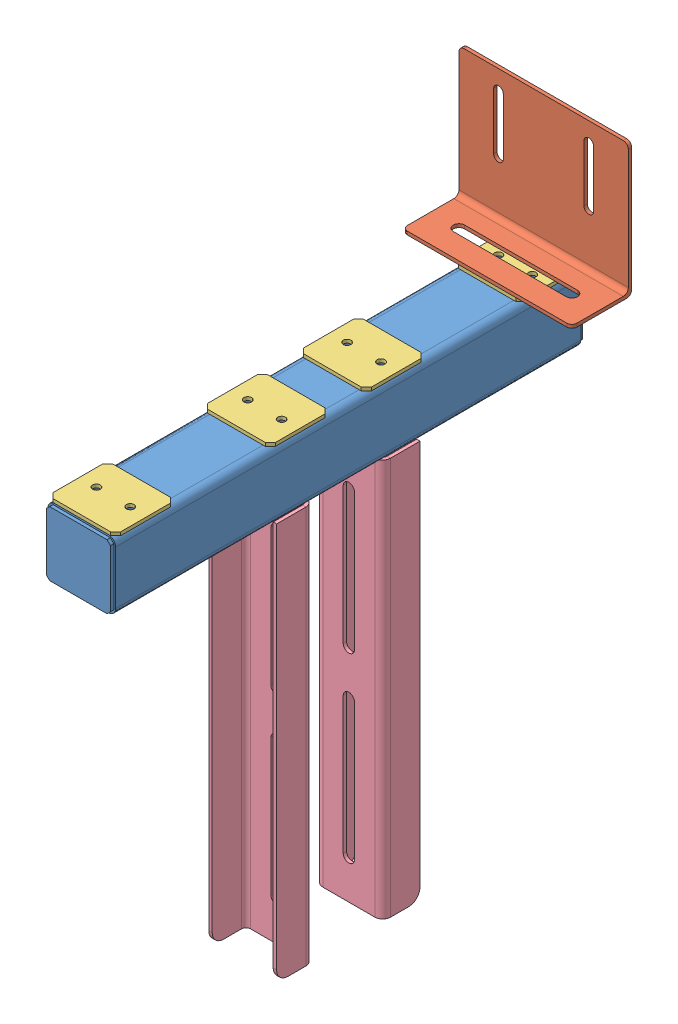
SolidWorks assembly 14L042 Fixation tapis prise sur support.SLDASM, configuration Défaut (file format 10000). Lengths in mm.
Overall size (150 533 418).
11 component instances, 4 part files, 30 mates.
Components (placement in the parent):
- 14L422 Support convoyeur Tapis-1: 14L422 Support convoyeur Tapis.SLDPRT [Défaut<Brut d'usinage>] at (0 0 8) size (60 60 418)
- 14L421 Equerre de fixation convoyeurs-1: 14L421 Equerre de fixation convoyeurs.SLDPRT [Défaut] at (-50 33 -379) x (0 0 1) z (0 1 0) size (53 150 118) (hidden)
- 14L421 Equerre de fixation convoyeurs-2: 14L421 Equerre de fixation convoyeurs.SLDPRT [Défaut] at (50 33 -23) x (0 0 -1) z (0 1 0) size (53 150 118) (hidden)
- 14L421 Equerre de fixation convoyeurs-3: 14L421 Equerre de fixation convoyeurs.SLDPRT [Défaut] at (50 33 -245) x (0 0 -1) z (0 1 0) size (53 150 118) (hidden)
- 14L421 Equerre de fixation convoyeurs-4: 14L421 Equerre de fixation convoyeurs.SLDPRT [Défaut] at (-50 33 -157) x (0 0 1) z (0 1 0) size (53 150 118) (hidden)
- 14L425 Support équerre soudé-1: 14L425 Support équerre soudé.SLDPRT [Défaut] at (-30 30 -407) x (0 0 1) z (0 1 0) size (53 60 3)
- 14L425 Support équerre soudé-2: 14L425 Support équerre soudé.SLDPRT [Défaut] at (30 30 -217) x (0 0 -1) z (0 1 0) size (53 60 3)
- 14L425 Support équerre soudé-3: 14L425 Support équerre soudé.SLDPRT [Défaut] at (-30 30 -185) x (0 0 1) z (0 1 0) size (53 60 3)
- 14L425 Support équerre soudé-4: 14L425 Support équerre soudé.SLDPRT [Défaut] at (30 30 5) x (0 0 -1) z (0 1 0) size (53 60 3)
- 14L425 Equerre Reglage-1: 14L425 Equerre Reglage.SLDPRT [Défaut] at (-30 -382 -170.5) size (60 352 33)
- 14L425 Equerre Reglage-2: 14L425 Equerre Reglage.SLDPRT [Défaut] at (30 -382 -231.5) x (-1 0 0) z (0 0 -1) size (60 352 33)
Mates (geometry in assembly coordinates):
- Coïncidente1: coincident aligned: plane of 14L422 Support convoyeur Tapis-1 through (53.8 0 -407) normal (0 0 -1); plane of 14L421 Equerre de fixation convoyeurs-1 through (-148.5884 92 -407) normal (0 0 -1)
- Coïncidente7: coincident aligned: plane of 14L421 Equerre de fixation convoyeurs-2 through (148.5884 92 5) normal (0 0 1); plane of 14L422 Support convoyeur Tapis-1 through (0 53.8 5) normal (0 0 1)
- Distance1: distance = 3 mm anti-aligned: plane of 14L421 Equerre de fixation convoyeurs-1 through (-75 33 -354) normal (0 -1 0); plane of 14L422 Support convoyeur Tapis-1 through (23.6 30 -410) normal (0 1 0)
- Distance2: distance = 3 mm anti-aligned: plane of 14L422 Support convoyeur Tapis-1 through (23.6 30 -410) normal (0 1 0); plane of 14L421 Equerre de fixation convoyeurs-3 through (75 33 -270) normal (0 -1 0)
- Distance3: distance = 3 mm anti-aligned: plane of 14L422 Support convoyeur Tapis-1 through (23.6 30 -410) normal (0 1 0); plane of 14L421 Equerre de fixation convoyeurs-2 through (75 33 -48) normal (0 -1 0)
- Distance4: distance = 3 mm anti-aligned: plane of 14L421 Equerre de fixation convoyeurs-4 through (-75 33 -132) normal (0 -1 0); plane of 14L422 Support convoyeur Tapis-1 through (23.6 30 -410) normal (0 1 0)
- Distance5: distance = 184 mm anti-aligned: plane of 14L421 Equerre de fixation convoyeurs-4 through (-148.5884 92 -182) normal (0 0 1); plane of 14L421 Equerre de fixation convoyeurs-2 through (148.5884 92 2) normal (0 0 -1)
- Distance6: distance = 184 mm anti-aligned: plane of 14L421 Equerre de fixation convoyeurs-1 through (-148.5884 92 -404) normal (0 0 1); plane of 14L421 Equerre de fixation convoyeurs-3 through (148.5884 92 -220) normal (0 0 -1)
- Coïncidente15: coincident aligned: plane of 14L421 Equerre de fixation convoyeurs-1 through (-75 36 -404) normal (-1 0 0); plane of 14L421 Equerre de fixation convoyeurs-3 through (-75 36 -220) normal (-1 0 0)
- Coïncidente16: coincident aligned: plane of 14L421 Equerre de fixation convoyeurs-3 through (-75 36 -220) normal (-1 0 0); plane of 14L421 Equerre de fixation convoyeurs-4 through (-75 36 -182) normal (-1 0 0)
- Coïncidente17: coincident aligned: plane of 14L421 Equerre de fixation convoyeurs-2 through (-75 36 2) normal (-1 0 0); plane of 14L421 Equerre de fixation convoyeurs-4 through (-75 36 -182) normal (-1 0 0)
- Distance10: distance = 45 mm aligned: plane of 14L422 Support convoyeur Tapis-1 through (-30 -23.6 -410) normal (-1 0 0); plane of 14L421 Equerre de fixation convoyeurs-1 through (-75 36 -404) normal (-1 0 0)
- Coïncidente28: coincident aligned: plane of 14L422 Support convoyeur Tapis-1 through (30 23.6 -410) normal (1 0 0); plane of 14L425 Support équerre soudé-4 through (30 33 5) normal (1 0 0)
- Coïncidente19: coincident aligned: plane of 14L422 Support convoyeur Tapis-1 through (-30 -23.6 -410) normal (-1 0 0); plane of 14L425 Support équerre soudé-1 through (-30 33 -407) normal (-1 0 0)
- Coïncidente20: coincident aligned: plane of 14L422 Support convoyeur Tapis-1 through (53.8 0 -407) normal (0 0 -1); plane of 14L425 Support équerre soudé-1 through (-30 33 -407) normal (0 0 -1)
- Coïncidente18: coincident anti-aligned: plane of 14L425 Support équerre soudé-1 through (30 30 -407) normal (0 -1 0); plane of 14L422 Support convoyeur Tapis-1 through (23.6 30 -410) normal (0 1 0)
- Coïncidente21: coincident anti-aligned: plane of 14L422 Support convoyeur Tapis-1 through (23.6 30 -410) normal (0 1 0); plane of 14L425 Support équerre soudé-2 through (-30 30 -217) normal (0 -1 0)
- Coïncidente22: coincident aligned: plane of 14L422 Support convoyeur Tapis-1 through (-30 -23.6 -410) normal (-1 0 0); plane of 14L425 Support équerre soudé-2 through (-30 33 -217) normal (-1 0 0)
- Coïncidente24: coincident aligned: plane of 14L421 Equerre de fixation convoyeurs-3 through (-75 36 -270) normal (0 0 -1); plane of 14L425 Support équerre soudé-2 through (30 33 -270) normal (0 0 -1)
- Coïncidente25: coincident anti-aligned: plane of 14L422 Support convoyeur Tapis-1 through (23.6 30 -410) normal (0 1 0); plane of 14L425 Support équerre soudé-3 through (30 30 -185) normal (0 -1 0)
- Coïncidente26: coincident aligned: plane of 14L422 Support convoyeur Tapis-1 through (-30 -23.6 -410) normal (-1 0 0); plane of 14L425 Support équerre soudé-3 through (-30 33 -185) normal (-1 0 0)
- Coïncidente27: coincident anti-aligned: plane of 14L422 Support convoyeur Tapis-1 through (23.6 30 -410) normal (0 1 0); plane of 14L425 Support équerre soudé-4 through (-30 30 5) normal (0 -1 0)
- Coïncidente29: coincident aligned: plane of 14L422 Support convoyeur Tapis-1 through (0 53.8 5) normal (0 0 1); plane of 14L425 Support équerre soudé-4 through (30 33 5) normal (0 0 1)
- Coïncidente30: coincident aligned: plane of 14L421 Equerre de fixation convoyeurs-4 through (75 36 -132) normal (0 0 1); plane of 14L425 Support équerre soudé-3 through (-30 33 -132) normal (0 0 1)
- Coïncidente31: coincident anti-aligned: plane of 14L422 Support convoyeur Tapis-1 through (-23.6 -30 -410) normal (0 -1 0); plane of 14L425 Equerre Reglage-1 through (-30 -30 -167.5) normal (0 1 0)
- Coïncidente32: coincident anti-aligned: plane of 14L422 Support convoyeur Tapis-1 through (-23.6 -30 -410) normal (0 -1 0); plane of 14L425 Equerre Reglage-2 through (30 -30 -234.5) normal (0 1 0)
- Coïncidente34: coincident aligned: plane of 14L422 Support convoyeur Tapis-1 through (-30 -23.6 -410) normal (-1 0 0); plane of 14L425 Equerre Reglage-2 through (-30 -382 -264.5) normal (-1 0 0)
- Coïncidente35: coincident aligned: plane of 14L422 Support convoyeur Tapis-1 through (-30 -23.6 -410) normal (-1 0 0); plane of 14L425 Equerre Reglage-1 through (-30 -30 -137.5) normal (-1 0 0)
- Distance12: distance = 30.5 mm: line of assembly; plane of 14L425 Equerre Reglage-2 through (30 -30 -231.5) normal (0 0 1)
- Distance13: distance = 30.5 mm: plane of 14L425 Equerre Reglage-1 through (-30 -30 -170.5) normal (0 0 -1); line of assembly
